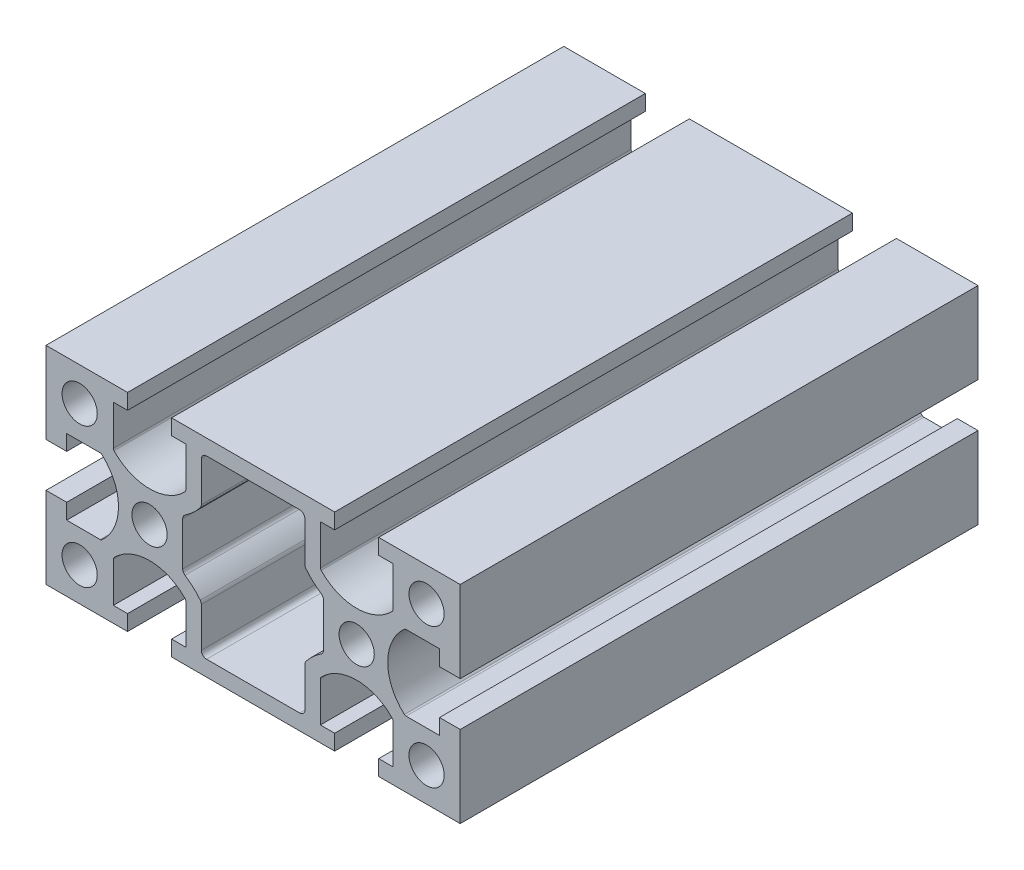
from build123d import *

# Parameters (mm, degrees)
SKETCH_1_W                    = 80
SKETCH_1_H                    = 40
EXTRUDE_1_DEPTH               = 50
SKETCH_2_R                    = 3.4
CUT_EXTRUDE_1_DEPTH           = 110.544511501
SKETCH_3_R                    = 3.4
CUT_EXTRUDE_2_DEPTH           = 110.544511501
CUT_EXTRUDE_3_DEPTH           = 110.544511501
PATTERN_LINEAR_1_COUNT        = 2
PATTERN_LINEAR_1_PITCH        = 40
PATTERN_LINEAR_1_COPY_1_DEPTH = 110.544511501
CUT_EXTRUDE_4_DEPTH           = 110.544511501
CUT_EXTRUDE_5_DEPTH           = 110.544511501


with BuildPart() as part:
    # Sketch 1 → Extrude 1 (new, symmetric)
    with BuildSketch(Plane.XY):
        Rectangle(SKETCH_1_W, SKETCH_1_H)
    extrude(amount=EXTRUDE_1_DEPTH, both=True)

    # Sketch 2 → Cut-Extrude 1 (cut, through all)
    with BuildSketch(Plane.XY.offset(50)):
        with Locations((-20, 0)):
            Circle(SKETCH_2_R)
        with Locations((20, 0)):
            Circle(SKETCH_2_R)
    extrude(amount=-CUT_EXTRUDE_1_DEPTH, mode=Mode.SUBTRACT)

    # Sketch 3 → Cut-Extrude 2 (cut, through all)
    with BuildSketch(Plane.XY.offset(50)):
        with Locations((-33.5, 13.5)):
            Circle(SKETCH_3_R)
        with Locations((33.5, 13.5)):
            Circle(SKETCH_3_R)
        with Locations((33.5, -13.5)):
            Circle(SKETCH_3_R)
        with Locations((-33.5, -13.5)):
            Circle(SKETCH_3_R)
    extrude(amount=-CUT_EXTRUDE_2_DEPTH, mode=Mode.SUBTRACT)

    # Sketch 4 → Cut-Extrude 3 (cut, through all)
    with BuildSketch(Plane.XY.offset(50)):
        with BuildLine():
            Line((15.75, 20), (24.25, 20))
            Line((24.25, 20), (24.25, 17))
            Line((24.25, 17), (27, 17))
            Line((27, 17), (27, 9.275050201))
            ThreePointArc((27, 9.275050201), (26.963980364, 9.088711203), (26.861111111, 8.929219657))
            ThreePointArc((26.861111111, 8.929219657), (20, 6), (13.138888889, 8.929219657))
            ThreePointArc((13.138888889, 8.929219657), (13.036019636, 9.088711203), (13, 9.275050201))
            Line((13, 9.275050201), (13, 17))
            Line((13, 17), (15.75, 17))
            Line((15.75, 17), (15.75, 20))
        make_face()
    cut_extrude_3 = extrude(amount=-CUT_EXTRUDE_3_DEPTH, mode=Mode.SUBTRACT)

    # Mirror 1: Cut-Extrude 3 across plane
    add(cut_extrude_3.mirror(Plane.ZX), mode=Mode.SUBTRACT)

    # Pattern Linear 1: Cut-Extrude 3 ×2
    with Locations(*[(-i * PATTERN_LINEAR_1_PITCH, 0, 0) for i in range(1, PATTERN_LINEAR_1_COUNT)]):
        add(cut_extrude_3, mode=Mode.SUBTRACT)

    # Pattern Linear 1 copy 1 sketch → Pattern Linear 1 copy 1 (cut, through all)
    with BuildSketch(Plane(origin=(-40, 0, 50), x_dir=(1, 0, 0), z_dir=(0, 0, 1))):
        with BuildLine():
            Line((15.75, -20), (24.25, -20))
            Line((24.25, -20), (24.25, -17))
            Line((24.25, -17), (27, -17))
            Line((27, -17), (27, -9.275050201))
            ThreePointArc((27, -9.275050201), (26.963980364, -9.088711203), (26.861111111, -8.929219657))
            ThreePointArc((26.861111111, -8.929219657), (20, -6), (13.138888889, -8.929219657))
            ThreePointArc((13.138888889, -8.929219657), (13.036019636, -9.088711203), (13, -9.275050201))
            Line((13, -9.275050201), (13, -17))
            Line((13, -17), (15.75, -17))
            Line((15.75, -17), (15.75, -20))
        make_face()
    extrude(amount=-PATTERN_LINEAR_1_COPY_1_DEPTH, mode=Mode.SUBTRACT)

    # Sketch 5 → Cut-Extrude 4 (cut, through all)
    with BuildSketch(Plane.XY.offset(50)):
        with BuildLine():
            Line((-40, -4.25), (-40, 4.25))
            Line((-40, 4.25), (-36, 4.25))
            Line((-36, 4.25), (-36, 7.25))
            Line((-36, 7.25), (-29.54705955, 7.25))
            ThreePointArc((-29.54705955, 7.25), (-29.370282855, 7.217707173), (-29.216340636, 7.125))
            ThreePointArc((-29.216340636, 7.125), (-26, 0), (-29.216340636, -7.125))
            ThreePointArc((-29.216340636, -7.125), (-29.370282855, -7.217707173), (-29.54705955, -7.25))
            Line((-29.54705955, -7.25), (-36, -7.25))
            Line((-36, -7.25), (-36, -4.25))
            Line((-36, -4.25), (-40, -4.25))
        make_face()
    cut_extrude_4 = extrude(amount=-CUT_EXTRUDE_4_DEPTH, mode=Mode.SUBTRACT)

    # Mirror 2: Cut-Extrude 4 across plane
    add(cut_extrude_4.mirror(Plane(origin=(0, 0, 0), x_dir=(0, 0, 1), z_dir=(1, 0, 0))), mode=Mode.SUBTRACT)

    # Sketch 7 → Cut-Extrude 5 (cut, through all)
    with BuildSketch(Plane.XY.offset(50)):
        with BuildLine():
            Line((-9, 17), (9, 17))
            ThreePointArc((9, 17), (9.707106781, 16.707106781), (10, 16))
            Line((10, 16), (10, 8.341089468))
            ThreePointArc((10, 8.341089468), (10.055910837, 8.011399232), (10.217391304, 7.718575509))
            ThreePointArc((10.217391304, 7.718575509), (11.576045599, 6.264904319), (13.148148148, 5.045234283))
            ThreePointArc((13.148148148, 5.045234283), (13.479814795, 4.684169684), (13.6, 4.208853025))
            Line((13.6, 4.208853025), (13.6, -4.208853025))
            ThreePointArc((13.6, -4.208853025), (13.479814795, -4.684169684), (13.148148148, -5.045234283))
            ThreePointArc((13.148148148, -5.045234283), (11.576045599, -6.264904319), (10.217391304, -7.718575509))
            ThreePointArc((10.217391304, -7.718575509), (10.055910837, -8.011399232), (10, -8.341089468))
            Line((10, -8.341089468), (10, -16))
            ThreePointArc((10, -16), (9.707106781, -16.707106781), (9, -17))
            Line((9, -17), (-9, -17))
            ThreePointArc((-9, -17), (-9.707106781, -16.707106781), (-10, -16))
            Line((-10, -16), (-10, -8.341089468))
            ThreePointArc((-10, -8.341089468), (-10.055910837, -8.011399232), (-10.217391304, -7.718575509))
            ThreePointArc((-10.217391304, -7.718575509), (-11.576045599, -6.264904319), (-13.148148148, -5.045234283))
            ThreePointArc((-13.148148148, -5.045234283), (-13.479814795, -4.684169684), (-13.6, -4.208853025))
            Line((-13.6, -4.208853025), (-13.6, 4.208853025))
            ThreePointArc((-13.6, 4.208853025), (-13.479814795, 4.684169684), (-13.148148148, 5.045234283))
            ThreePointArc((-13.148148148, 5.045234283), (-11.576045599, 6.264904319), (-10.217391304, 7.718575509))
            ThreePointArc((-10.217391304, 7.718575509), (-10.055910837, 8.011399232), (-10, 8.341089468))
            Line((-10, 8.341089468), (-10, 16))
            ThreePointArc((-10, 16), (-9.707106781, 16.707106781), (-9, 17))
        make_face()
    extrude(amount=-CUT_EXTRUDE_5_DEPTH, mode=Mode.SUBTRACT)


solid = part.part
